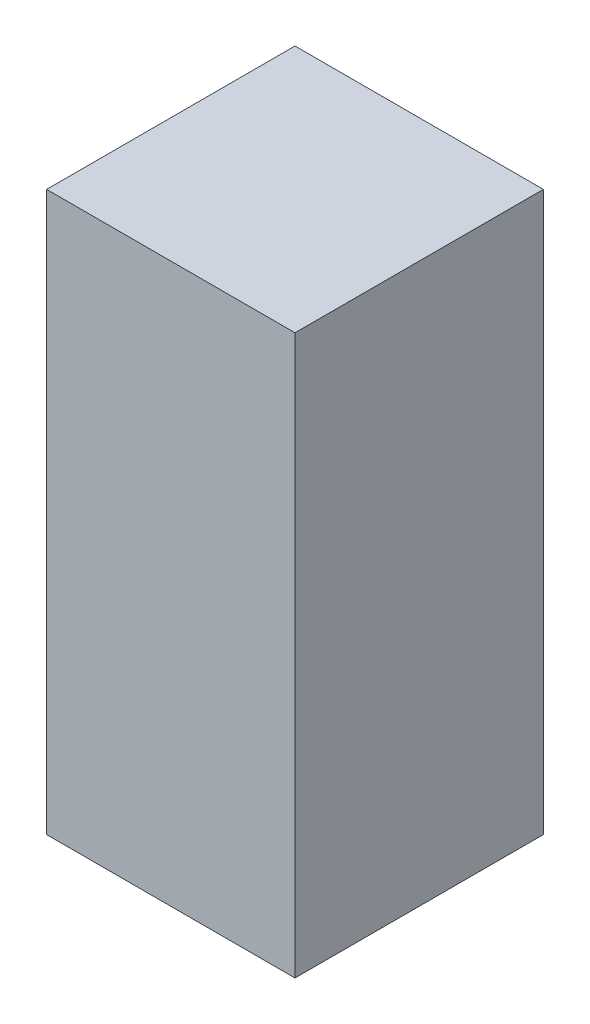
ISO-10303-21;
HEADER;
FILE_DESCRIPTION(('STEP AP214'),'2;1');
FILE_NAME('part.step','',(''),(''),'','','');
FILE_SCHEMA(('AUTOMOTIVE_DESIGN { 1 0 10303 214 1 1 1 1 }'));
ENDSEC;
DATA;
#1=APPLICATION_CONTEXT('core data for automotive mechanical design processes');
#2=APPLICATION_PROTOCOL_DEFINITION('international standard','automotive_design',2000,#1);
#3=PRODUCT_CONTEXT('',#1,'mechanical');
#4=PRODUCT('Part','Part','',(#3));
#5=PRODUCT_RELATED_PRODUCT_CATEGORY('part','',(#4));
#6=PRODUCT_DEFINITION_FORMATION('','',#4);
#7=PRODUCT_DEFINITION_CONTEXT('part definition',#1,'design');
#8=PRODUCT_DEFINITION('design','',#6,#7);
#9=PRODUCT_DEFINITION_SHAPE('','',#8);
#10=(LENGTH_UNIT() NAMED_UNIT(*) SI_UNIT(.MILLI.,.METRE.));
#11=(NAMED_UNIT(*) PLANE_ANGLE_UNIT() SI_UNIT($,.RADIAN.));
#12=(NAMED_UNIT(*) SI_UNIT($,.STERADIAN.) SOLID_ANGLE_UNIT());
#13=UNCERTAINTY_MEASURE_WITH_UNIT(LENGTH_MEASURE(1.E-05),#10,'distance_accuracy_value','');
#14=(GEOMETRIC_REPRESENTATION_CONTEXT(3) GLOBAL_UNCERTAINTY_ASSIGNED_CONTEXT((#13)) GLOBAL_UNIT_ASSIGNED_CONTEXT((#10,
#11,#12)) REPRESENTATION_CONTEXT('',''));
#15=CARTESIAN_POINT('',(0.,0.,0.));
#16=DIRECTION('',(0.,0.,1.));
#17=DIRECTION('',(1.,0.,0.));
#18=AXIS2_PLACEMENT_3D('',#15,#16,#17);
#19=CARTESIAN_POINT('',(0.60000134,1.34999984,1.2));
#20=DIRECTION('',(0.,0.,-1.));
#21=DIRECTION('',(-1.,0.,0.));
#22=AXIS2_PLACEMENT_3D('',#19,#20,#21);
#23=PLANE('',#22);
#24=DIRECTION('',(0.,1.,0.));
#25=VECTOR('',#24,1.);
#26=CARTESIAN_POINT('',(-0.5999988,1.34999984,1.2));
#27=LINE('',#26,#25);
#28=CARTESIAN_POINT('',(-0.5999988,1.34999984,1.2));
#29=VERTEX_POINT('',#28);
#30=CARTESIAN_POINT('',(-0.5999988,-1.34999984,1.2));
#31=VERTEX_POINT('',#30);
#32=EDGE_CURVE('E55',#29,#31,#27,.F.);
#33=ORIENTED_EDGE('',*,*,#32,.T.);
#34=DIRECTION('',(1.,0.,0.));
#35=VECTOR('',#34,1.);
#36=CARTESIAN_POINT('',(-0.5999988,-1.34999984,1.2));
#37=LINE('',#36,#35);
#38=CARTESIAN_POINT('',(0.60000134,-1.34999984,1.2));
#39=VERTEX_POINT('',#38);
#40=EDGE_CURVE('E58',#31,#39,#37,.T.);
#41=ORIENTED_EDGE('',*,*,#40,.T.);
#42=DIRECTION('',(0.,1.,0.));
#43=VECTOR('',#42,1.);
#44=CARTESIAN_POINT('',(0.60000134,-1.34999984,1.2));
#45=LINE('',#44,#43);
#46=CARTESIAN_POINT('',(0.60000134,1.34999984,1.2));
#47=VERTEX_POINT('',#46);
#48=EDGE_CURVE('E60',#39,#47,#45,.T.);
#49=ORIENTED_EDGE('',*,*,#48,.T.);
#50=DIRECTION('',(-1.,0.,0.));
#51=VECTOR('',#50,1.);
#52=CARTESIAN_POINT('',(0.60000134,1.34999984,1.2));
#53=LINE('',#52,#51);
#54=EDGE_CURVE('E20',#29,#47,#53,.F.);
#55=ORIENTED_EDGE('',*,*,#54,.F.);
#56=EDGE_LOOP('',(#33,#41,#49,#55));
#57=FACE_BOUND('',#56,.T.);
#58=ADVANCED_FACE('F17',(#57),#23,.F.);
#59=CARTESIAN_POINT('',(0.60000134,-1.34999984,0.));
#60=DIRECTION('',(-1.,0.,0.));
#61=DIRECTION('',(0.,0.,1.));
#62=AXIS2_PLACEMENT_3D('',#59,#60,#61);
#63=PLANE('',#62);
#64=DIRECTION('',(0.,0.,-1.));
#65=VECTOR('',#64,1.);
#66=CARTESIAN_POINT('',(0.60000134,1.34999984,0.));
#67=LINE('',#66,#65);
#68=CARTESIAN_POINT('',(0.60000134,1.34999984,0.));
#69=VERTEX_POINT('',#68);
#70=EDGE_CURVE('E71',#69,#47,#67,.F.);
#71=ORIENTED_EDGE('',*,*,#70,.T.);
#72=ORIENTED_EDGE('',*,*,#48,.F.);
#73=DIRECTION('',(0.,0.,1.));
#74=VECTOR('',#73,1.);
#75=CARTESIAN_POINT('',(0.60000134,-1.34999984,0.));
#76=LINE('',#75,#74);
#77=CARTESIAN_POINT('',(0.60000134,-1.34999984,0.));
#78=VERTEX_POINT('',#77);
#79=EDGE_CURVE('E65',#39,#78,#76,.F.);
#80=ORIENTED_EDGE('',*,*,#79,.T.);
#81=DIRECTION('',(0.,1.,0.));
#82=VECTOR('',#81,1.);
#83=CARTESIAN_POINT('',(0.60000134,1.34999984,0.));
#84=LINE('',#83,#82);
#85=EDGE_CURVE('E83',#69,#78,#84,.F.);
#86=ORIENTED_EDGE('',*,*,#85,.F.);
#87=EDGE_LOOP('',(#71,#72,#80,#86));
#88=FACE_BOUND('',#87,.T.);
#89=ADVANCED_FACE('F68',(#88),#63,.F.);
#90=CARTESIAN_POINT('',(-0.5999988,-1.34999984,0.));
#91=DIRECTION('',(0.,1.,0.));
#92=DIRECTION('',(0.,0.,1.));
#93=AXIS2_PLACEMENT_3D('',#90,#91,#92);
#94=PLANE('',#93);
#95=ORIENTED_EDGE('',*,*,#79,.F.);
#96=ORIENTED_EDGE('',*,*,#40,.F.);
#97=DIRECTION('',(0.,0.,-1.));
#98=VECTOR('',#97,1.);
#99=CARTESIAN_POINT('',(-0.5999988,-1.34999984,0.));
#100=LINE('',#99,#98);
#101=CARTESIAN_POINT('',(-0.5999988,-1.34999984,0.));
#102=VERTEX_POINT('',#101);
#103=EDGE_CURVE('E77',#31,#102,#100,.T.);
#104=ORIENTED_EDGE('',*,*,#103,.T.);
#105=DIRECTION('',(-1.,0.,0.));
#106=VECTOR('',#105,1.);
#107=CARTESIAN_POINT('',(0.60000134,-1.34999984,0.));
#108=LINE('',#107,#106);
#109=EDGE_CURVE('E74',#78,#102,#108,.T.);
#110=ORIENTED_EDGE('',*,*,#109,.F.);
#111=EDGE_LOOP('',(#95,#96,#104,#110));
#112=FACE_BOUND('',#111,.T.);
#113=ADVANCED_FACE('F72',(#112),#94,.F.);
#114=CARTESIAN_POINT('',(-0.5999988,1.34999984,0.));
#115=DIRECTION('',(1.,0.,0.));
#116=DIRECTION('',(0.,0.,-1.));
#117=AXIS2_PLACEMENT_3D('',#114,#115,#116);
#118=PLANE('',#117);
#119=ORIENTED_EDGE('',*,*,#103,.F.);
#120=ORIENTED_EDGE('',*,*,#32,.F.);
#121=DIRECTION('',(0.,0.,-1.));
#122=VECTOR('',#121,1.);
#123=CARTESIAN_POINT('',(-0.5999988,1.34999984,0.));
#124=LINE('',#123,#122);
#125=CARTESIAN_POINT('',(-0.5999988,1.34999984,0.));
#126=VERTEX_POINT('',#125);
#127=EDGE_CURVE('E35',#29,#126,#124,.T.);
#128=ORIENTED_EDGE('',*,*,#127,.T.);
#129=DIRECTION('',(0.,1.,0.));
#130=VECTOR('',#129,1.);
#131=CARTESIAN_POINT('',(-0.5999988,1.34999984,0.));
#132=LINE('',#131,#130);
#133=EDGE_CURVE('E26',#102,#126,#132,.T.);
#134=ORIENTED_EDGE('',*,*,#133,.F.);
#135=EDGE_LOOP('',(#119,#120,#128,#134));
#136=FACE_BOUND('',#135,.T.);
#137=ADVANCED_FACE('F89',(#136),#118,.F.);
#138=CARTESIAN_POINT('',(0.60000134,1.34999984,0.));
#139=DIRECTION('',(0.,-1.,0.));
#140=DIRECTION('',(0.,0.,-1.));
#141=AXIS2_PLACEMENT_3D('',#138,#139,#140);
#142=PLANE('',#141);
#143=ORIENTED_EDGE('',*,*,#127,.F.);
#144=ORIENTED_EDGE('',*,*,#54,.T.);
#145=ORIENTED_EDGE('',*,*,#70,.F.);
#146=DIRECTION('',(-1.,0.,0.));
#147=VECTOR('',#146,1.);
#148=CARTESIAN_POINT('',(0.60000134,1.34999984,0.));
#149=LINE('',#148,#147);
#150=EDGE_CURVE('E11',#126,#69,#149,.F.);
#151=ORIENTED_EDGE('',*,*,#150,.F.);
#152=EDGE_LOOP('',(#143,#144,#145,#151));
#153=FACE_BOUND('',#152,.T.);
#154=ADVANCED_FACE('F91',(#153),#142,.F.);
#155=CARTESIAN_POINT('',(0.60000134,1.34999984,0.));
#156=DIRECTION('',(0.,0.,-1.));
#157=DIRECTION('',(-1.,0.,0.));
#158=AXIS2_PLACEMENT_3D('',#155,#156,#157);
#159=PLANE('',#158);
#160=ORIENTED_EDGE('',*,*,#133,.T.);
#161=ORIENTED_EDGE('',*,*,#150,.T.);
#162=ORIENTED_EDGE('',*,*,#85,.T.);
#163=ORIENTED_EDGE('',*,*,#109,.T.);
#164=EDGE_LOOP('',(#160,#161,#162,#163));
#165=FACE_BOUND('',#164,.T.);
#166=ADVANCED_FACE('F88',(#165),#159,.T.);
#167=CLOSED_SHELL('',(#58,#89,#113,#137,#154,#166));
#168=MANIFOLD_SOLID_BREP('B1',#167);
#169=ADVANCED_BREP_SHAPE_REPRESENTATION('',(#18,#168),#14);
#170=SHAPE_DEFINITION_REPRESENTATION(#9,#169);
ENDSEC;
END-ISO-10303-21;
